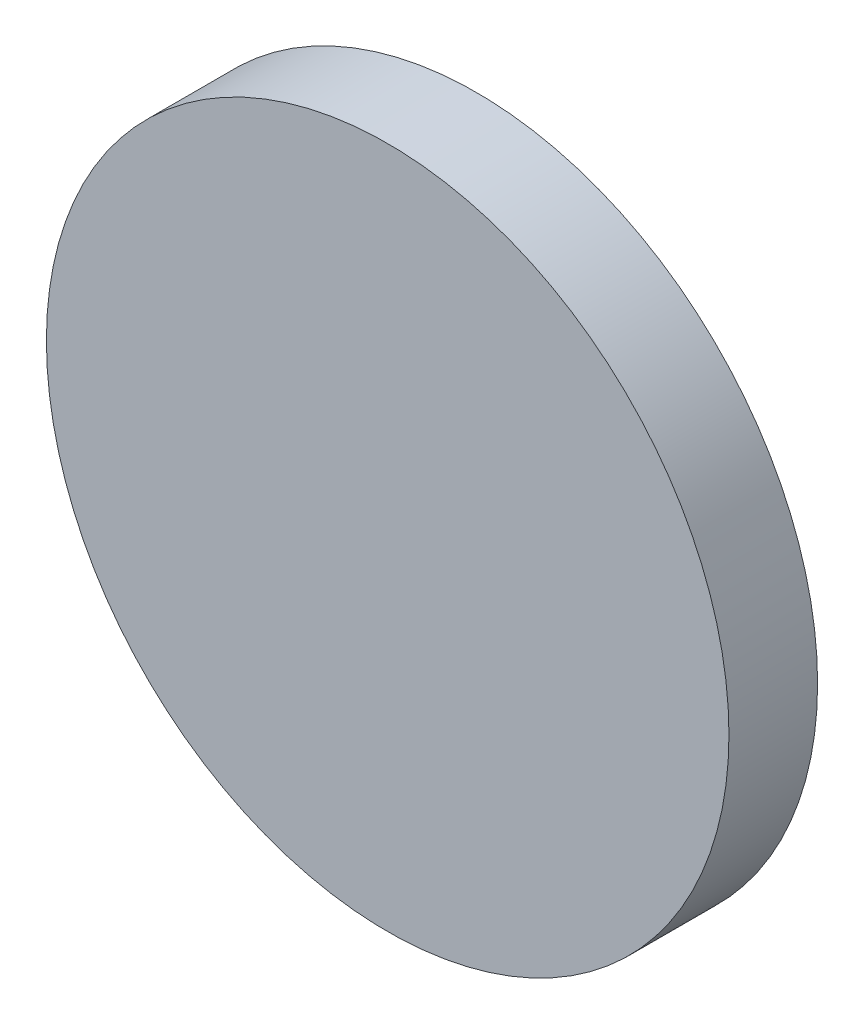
from build123d import *

# Parameters (mm, degrees)
SKETCH_1_R      = 3.85
EXTRUDE_1_DEPTH = 1


with BuildPart() as part:
    # Sketch 1 → Extrude 1 (new body)
    with BuildSketch(Plane.XY):
        Circle(SKETCH_1_R)
    extrude(amount=EXTRUDE_1_DEPTH)


solid = part.part
